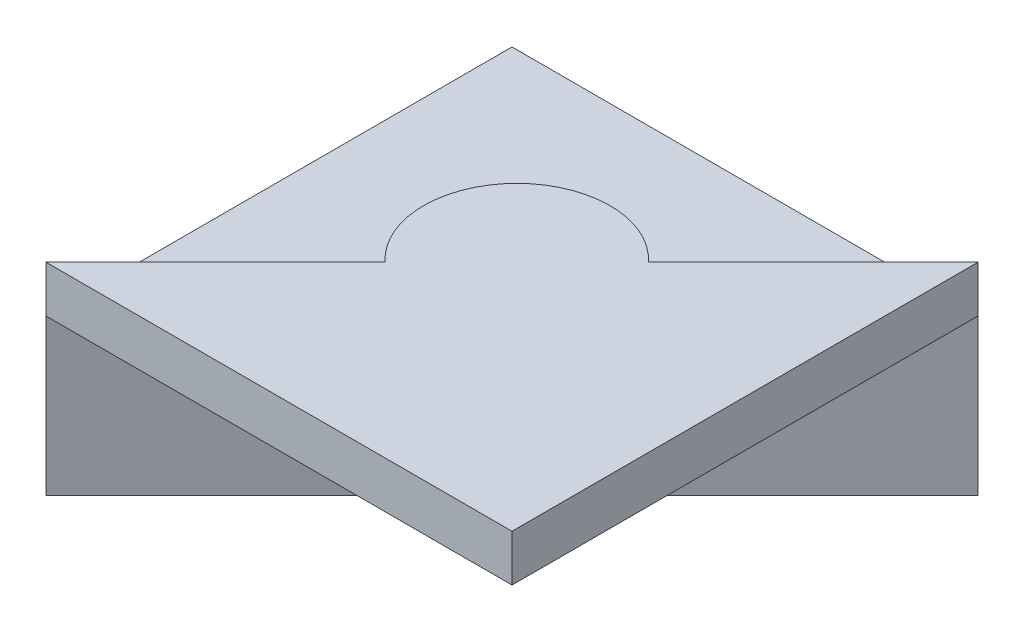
ISO-10303-21;
HEADER;
FILE_DESCRIPTION(('STEP AP214'),'2;1');
FILE_NAME('part.step','',(''),(''),'','','');
FILE_SCHEMA(('AUTOMOTIVE_DESIGN { 1 0 10303 214 1 1 1 1 }'));
ENDSEC;
DATA;
#1=APPLICATION_CONTEXT('core data for automotive mechanical design processes');
#2=APPLICATION_PROTOCOL_DEFINITION('international standard','automotive_design',2000,#1);
#3=PRODUCT_CONTEXT('',#1,'mechanical');
#4=PRODUCT('Part','Part','',(#3));
#5=PRODUCT_RELATED_PRODUCT_CATEGORY('part','',(#4));
#6=PRODUCT_DEFINITION_FORMATION('','',#4);
#7=PRODUCT_DEFINITION_CONTEXT('part definition',#1,'design');
#8=PRODUCT_DEFINITION('design','',#6,#7);
#9=PRODUCT_DEFINITION_SHAPE('','',#8);
#10=(LENGTH_UNIT() NAMED_UNIT(*) SI_UNIT(.MILLI.,.METRE.));
#11=(NAMED_UNIT(*) PLANE_ANGLE_UNIT() SI_UNIT($,.RADIAN.));
#12=(NAMED_UNIT(*) SI_UNIT($,.STERADIAN.) SOLID_ANGLE_UNIT());
#13=UNCERTAINTY_MEASURE_WITH_UNIT(LENGTH_MEASURE(1.E-05),#10,'distance_accuracy_value','');
#14=(GEOMETRIC_REPRESENTATION_CONTEXT(3) GLOBAL_UNCERTAINTY_ASSIGNED_CONTEXT((#13)) GLOBAL_UNIT_ASSIGNED_CONTEXT((#10,
#11,#12)) REPRESENTATION_CONTEXT('',''));
#15=CARTESIAN_POINT('',(0.,0.,0.));
#16=DIRECTION('',(0.,0.,1.));
#17=DIRECTION('',(1.,0.,0.));
#18=AXIS2_PLACEMENT_3D('',#15,#16,#17);
#19=CARTESIAN_POINT('',(-15.,13.,14.6929266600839));
#20=DIRECTION('',(0.,-1.,0.));
#21=DIRECTION('',(0.,0.,-1.));
#22=AXIS2_PLACEMENT_3D('',#19,#20,#21);
#23=CYLINDRICAL_SURFACE('',#22,6.);
#24=CARTESIAN_POINT('',(-15.,10.,14.6929266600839));
#25=DIRECTION('',(0.,1.,0.));
#26=DIRECTION('',(0.,0.,1.));
#27=AXIS2_PLACEMENT_3D('',#24,#25,#26);
#28=CIRCLE('',#27,6.);
#29=CARTESIAN_POINT('',(-10.6066017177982,10.,10.6066017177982));
#30=VERTEX_POINT('',#29);
#31=CARTESIAN_POINT('',(-19.0863249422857,10.,19.0863249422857));
#32=VERTEX_POINT('',#31);
#33=EDGE_CURVE('E93',#30,#32,#28,.T.);
#34=ORIENTED_EDGE('',*,*,#33,.T.);
#35=DIRECTION('',(0.,-1.,0.));
#36=VECTOR('',#35,1.);
#37=CARTESIAN_POINT('',(-19.0863249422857,13.,19.0863249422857));
#38=LINE('',#37,#36);
#39=CARTESIAN_POINT('',(-19.0863249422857,13.,19.0863249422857));
#40=VERTEX_POINT('',#39);
#41=EDGE_CURVE('E12',#40,#32,#38,.T.);
#42=ORIENTED_EDGE('',*,*,#41,.F.);
#43=CARTESIAN_POINT('',(-15.,13.,14.6929266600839));
#44=DIRECTION('',(0.,1.,0.));
#45=DIRECTION('',(0.,0.,1.));
#46=AXIS2_PLACEMENT_3D('',#43,#44,#45);
#47=CIRCLE('',#46,6.);
#48=CARTESIAN_POINT('',(-10.6066017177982,13.,10.6066017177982));
#49=VERTEX_POINT('',#48);
#50=EDGE_CURVE('E114',#49,#40,#47,.T.);
#51=ORIENTED_EDGE('',*,*,#50,.F.);
#52=DIRECTION('',(0.,-1.,0.));
#53=VECTOR('',#52,1.);
#54=CARTESIAN_POINT('',(-10.6066017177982,13.,10.6066017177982));
#55=LINE('',#54,#53);
#56=EDGE_CURVE('E106',#49,#30,#55,.T.);
#57=ORIENTED_EDGE('',*,*,#56,.T.);
#58=EDGE_LOOP('',(#34,#42,#51,#57));
#59=FACE_BOUND('',#58,.T.);
#60=ADVANCED_FACE('F43',(#59),#23,.T.);
#61=CARTESIAN_POINT('',(-30.,13.,30.));
#62=DIRECTION('',(0.707106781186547,0.,0.707106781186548));
#63=DIRECTION('',(0.707106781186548,0.,-0.707106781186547));
#64=AXIS2_PLACEMENT_3D('',#61,#62,#63);
#65=PLANE('',#64);
#66=DIRECTION('',(-0.707106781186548,0.,0.707106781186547));
#67=VECTOR('',#66,1.);
#68=CARTESIAN_POINT('',(-30.,10.,30.));
#69=LINE('',#68,#67);
#70=CARTESIAN_POINT('',(-30.,10.,30.));
#71=VERTEX_POINT('',#70);
#72=EDGE_CURVE('E89',#32,#71,#69,.T.);
#73=ORIENTED_EDGE('',*,*,#72,.T.);
#74=DIRECTION('',(0.,-1.,0.));
#75=VECTOR('',#74,1.);
#76=CARTESIAN_POINT('',(-30.,13.,30.));
#77=LINE('',#76,#75);
#78=CARTESIAN_POINT('',(-30.,13.,30.));
#79=VERTEX_POINT('',#78);
#80=EDGE_CURVE('E50',#79,#71,#77,.T.);
#81=ORIENTED_EDGE('',*,*,#80,.F.);
#82=DIRECTION('',(-0.707106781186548,0.,0.707106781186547));
#83=VECTOR('',#82,1.);
#84=CARTESIAN_POINT('',(-30.,13.,30.));
#85=LINE('',#84,#83);
#86=EDGE_CURVE('E102',#40,#79,#85,.T.);
#87=ORIENTED_EDGE('',*,*,#86,.F.);
#88=ORIENTED_EDGE('',*,*,#41,.T.);
#89=EDGE_LOOP('',(#73,#81,#87,#88));
#90=FACE_BOUND('',#89,.T.);
#91=ADVANCED_FACE('F101',(#90),#65,.F.);
#92=CARTESIAN_POINT('',(-30.,13.,30.));
#93=DIRECTION('',(0.,0.,-1.));
#94=DIRECTION('',(-1.,0.,0.));
#95=AXIS2_PLACEMENT_3D('',#92,#93,#94);
#96=PLANE('',#95);
#97=DIRECTION('',(1.,0.,0.));
#98=VECTOR('',#97,1.);
#99=CARTESIAN_POINT('',(-30.,10.,30.));
#100=LINE('',#99,#98);
#101=CARTESIAN_POINT('',(0.,10.,30.));
#102=VERTEX_POINT('',#101);
#103=EDGE_CURVE('E95',#71,#102,#100,.T.);
#104=ORIENTED_EDGE('',*,*,#103,.T.);
#105=DIRECTION('',(0.,-1.,0.));
#106=VECTOR('',#105,1.);
#107=CARTESIAN_POINT('',(0.,13.,30.));
#108=LINE('',#107,#106);
#109=CARTESIAN_POINT('',(0.,13.,30.));
#110=VERTEX_POINT('',#109);
#111=EDGE_CURVE('E125',#110,#102,#108,.T.);
#112=ORIENTED_EDGE('',*,*,#111,.F.);
#113=DIRECTION('',(1.,0.,0.));
#114=VECTOR('',#113,1.);
#115=CARTESIAN_POINT('',(-30.,13.,30.));
#116=LINE('',#115,#114);
#117=EDGE_CURVE('E117',#79,#110,#116,.T.);
#118=ORIENTED_EDGE('',*,*,#117,.F.);
#119=ORIENTED_EDGE('',*,*,#80,.T.);
#120=EDGE_LOOP('',(#104,#112,#118,#119));
#121=FACE_BOUND('',#120,.T.);
#122=ADVANCED_FACE('F129',(#121),#96,.F.);
#123=CARTESIAN_POINT('',(0.,13.,30.));
#124=DIRECTION('',(-1.,0.,0.));
#125=DIRECTION('',(0.,0.,1.));
#126=AXIS2_PLACEMENT_3D('',#123,#124,#125);
#127=PLANE('',#126);
#128=DIRECTION('',(0.,0.,-1.));
#129=VECTOR('',#128,1.);
#130=CARTESIAN_POINT('',(0.,10.,30.));
#131=LINE('',#130,#129);
#132=CARTESIAN_POINT('',(0.,10.,0.));
#133=VERTEX_POINT('',#132);
#134=EDGE_CURVE('E110',#102,#133,#131,.T.);
#135=ORIENTED_EDGE('',*,*,#134,.T.);
#136=DIRECTION('',(0.,-1.,0.));
#137=VECTOR('',#136,1.);
#138=CARTESIAN_POINT('',(0.,13.,0.));
#139=LINE('',#138,#137);
#140=CARTESIAN_POINT('',(0.,13.,0.));
#141=VERTEX_POINT('',#140);
#142=EDGE_CURVE('E122',#141,#133,#139,.T.);
#143=ORIENTED_EDGE('',*,*,#142,.F.);
#144=DIRECTION('',(0.,0.,-1.));
#145=VECTOR('',#144,1.);
#146=CARTESIAN_POINT('',(0.,13.,30.));
#147=LINE('',#146,#145);
#148=EDGE_CURVE('E62',#110,#141,#147,.T.);
#149=ORIENTED_EDGE('',*,*,#148,.F.);
#150=ORIENTED_EDGE('',*,*,#111,.T.);
#151=EDGE_LOOP('',(#135,#143,#149,#150));
#152=FACE_BOUND('',#151,.T.);
#153=ADVANCED_FACE('F140',(#152),#127,.F.);
#154=CARTESIAN_POINT('',(-10.6066017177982,13.,10.6066017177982));
#155=DIRECTION('',(0.707106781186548,0.,0.707106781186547));
#156=DIRECTION('',(0.707106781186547,0.,-0.707106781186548));
#157=AXIS2_PLACEMENT_3D('',#154,#155,#156);
#158=PLANE('',#157);
#159=DIRECTION('',(-0.707106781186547,0.,0.707106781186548));
#160=VECTOR('',#159,1.);
#161=CARTESIAN_POINT('',(-10.6066017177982,10.,10.6066017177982));
#162=LINE('',#161,#160);
#163=EDGE_CURVE('E112',#133,#30,#162,.T.);
#164=ORIENTED_EDGE('',*,*,#163,.T.);
#165=ORIENTED_EDGE('',*,*,#56,.F.);
#166=DIRECTION('',(-0.707106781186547,0.,0.707106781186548));
#167=VECTOR('',#166,1.);
#168=CARTESIAN_POINT('',(-10.6066017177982,13.,10.6066017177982));
#169=LINE('',#168,#167);
#170=EDGE_CURVE('E57',#141,#49,#169,.T.);
#171=ORIENTED_EDGE('',*,*,#170,.F.);
#172=ORIENTED_EDGE('',*,*,#142,.T.);
#173=EDGE_LOOP('',(#164,#165,#171,#172));
#174=FACE_BOUND('',#173,.T.);
#175=ADVANCED_FACE('F133',(#174),#158,.F.);
#176=CARTESIAN_POINT('',(-15.,13.,14.6929266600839));
#177=DIRECTION('',(0.,1.,0.));
#178=DIRECTION('',(0.,0.,1.));
#179=AXIS2_PLACEMENT_3D('',#176,#177,#178);
#180=PLANE('',#179);
#181=ORIENTED_EDGE('',*,*,#50,.T.);
#182=ORIENTED_EDGE('',*,*,#86,.T.);
#183=ORIENTED_EDGE('',*,*,#117,.T.);
#184=ORIENTED_EDGE('',*,*,#148,.T.);
#185=ORIENTED_EDGE('',*,*,#170,.T.);
#186=EDGE_LOOP('',(#181,#182,#183,#184,#185));
#187=FACE_BOUND('',#186,.T.);
#188=ADVANCED_FACE('F131',(#187),#180,.T.);
#189=CARTESIAN_POINT('',(-15.,10.,14.6929266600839));
#190=DIRECTION('',(0.,1.,0.));
#191=DIRECTION('',(0.,0.,1.));
#192=AXIS2_PLACEMENT_3D('',#189,#190,#191);
#193=PLANE('',#192);
#194=ORIENTED_EDGE('',*,*,#33,.F.);
#195=ORIENTED_EDGE('',*,*,#163,.F.);
#196=ORIENTED_EDGE('',*,*,#134,.F.);
#197=ORIENTED_EDGE('',*,*,#103,.F.);
#198=ORIENTED_EDGE('',*,*,#72,.F.);
#199=EDGE_LOOP('',(#194,#195,#196,#197,#198));
#200=FACE_BOUND('',#199,.T.);
#201=ADVANCED_FACE('F90',(#200),#193,.F.);
#202=CLOSED_SHELL('',(#60,#91,#122,#153,#175,#188,#201));
#203=MANIFOLD_SOLID_BREP('B2',#202);
#204=CARTESIAN_POINT('',(-10.6066017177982,10.,10.6066017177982));
#205=DIRECTION('',(-0.707106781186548,0.,-0.707106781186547));
#206=DIRECTION('',(-0.707106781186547,0.,0.707106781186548));
#207=AXIS2_PLACEMENT_3D('',#204,#205,#206);
#208=PLANE('',#207);
#209=DIRECTION('',(0.707106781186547,0.,-0.707106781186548));
#210=VECTOR('',#209,1.);
#211=CARTESIAN_POINT('',(-10.6066017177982,0.,10.6066017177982));
#212=LINE('',#211,#210);
#213=CARTESIAN_POINT('',(-10.6066017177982,0.,10.6066017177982));
#214=VERTEX_POINT('',#213);
#215=CARTESIAN_POINT('',(0.,0.,0.));
#216=VERTEX_POINT('',#215);
#217=EDGE_CURVE('E243',#214,#216,#212,.T.);
#218=ORIENTED_EDGE('',*,*,#217,.T.);
#219=DIRECTION('',(0.,-1.,0.));
#220=VECTOR('',#219,1.);
#221=CARTESIAN_POINT('',(0.,10.,0.));
#222=LINE('',#221,#220);
#223=CARTESIAN_POINT('',(0.,10.,0.));
#224=VERTEX_POINT('',#223);
#225=EDGE_CURVE('E41',#224,#216,#222,.T.);
#226=ORIENTED_EDGE('',*,*,#225,.F.);
#227=DIRECTION('',(0.707106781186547,0.,-0.707106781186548));
#228=VECTOR('',#227,1.);
#229=CARTESIAN_POINT('',(-10.6066017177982,10.,10.6066017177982));
#230=LINE('',#229,#228);
#231=CARTESIAN_POINT('',(-10.6066017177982,10.,10.6066017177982));
#232=VERTEX_POINT('',#231);
#233=EDGE_CURVE('E264',#232,#224,#230,.T.);
#234=ORIENTED_EDGE('',*,*,#233,.F.);
#235=DIRECTION('',(0.,-1.,0.));
#236=VECTOR('',#235,1.);
#237=CARTESIAN_POINT('',(-10.6066017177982,10.,10.6066017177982));
#238=LINE('',#237,#236);
#239=EDGE_CURVE('E256',#232,#214,#238,.T.);
#240=ORIENTED_EDGE('',*,*,#239,.T.);
#241=EDGE_LOOP('',(#218,#226,#234,#240));
#242=FACE_BOUND('',#241,.T.);
#243=ADVANCED_FACE('F193',(#242),#208,.F.);
#244=CARTESIAN_POINT('',(0.,10.,0.));
#245=DIRECTION('',(0.,0.,1.));
#246=DIRECTION('',(1.,0.,0.));
#247=AXIS2_PLACEMENT_3D('',#244,#245,#246);
#248=PLANE('',#247);
#249=DIRECTION('',(-1.,0.,0.));
#250=VECTOR('',#249,1.);
#251=CARTESIAN_POINT('',(0.,0.,0.));
#252=LINE('',#251,#250);
#253=CARTESIAN_POINT('',(-30.,0.,0.));
#254=VERTEX_POINT('',#253);
#255=EDGE_CURVE('E239',#216,#254,#252,.T.);
#256=ORIENTED_EDGE('',*,*,#255,.T.);
#257=DIRECTION('',(0.,-1.,0.));
#258=VECTOR('',#257,1.);
#259=CARTESIAN_POINT('',(-30.,10.,0.));
#260=LINE('',#259,#258);
#261=CARTESIAN_POINT('',(-30.,10.,0.));
#262=VERTEX_POINT('',#261);
#263=EDGE_CURVE('E200',#262,#254,#260,.T.);
#264=ORIENTED_EDGE('',*,*,#263,.F.);
#265=DIRECTION('',(-1.,0.,0.));
#266=VECTOR('',#265,1.);
#267=CARTESIAN_POINT('',(0.,10.,0.));
#268=LINE('',#267,#266);
#269=EDGE_CURVE('E252',#224,#262,#268,.T.);
#270=ORIENTED_EDGE('',*,*,#269,.F.);
#271=ORIENTED_EDGE('',*,*,#225,.T.);
#272=EDGE_LOOP('',(#256,#264,#270,#271));
#273=FACE_BOUND('',#272,.T.);
#274=ADVANCED_FACE('F251',(#273),#248,.F.);
#275=CARTESIAN_POINT('',(-30.,10.,0.));
#276=DIRECTION('',(1.,0.,0.));
#277=DIRECTION('',(0.,0.,-1.));
#278=AXIS2_PLACEMENT_3D('',#275,#276,#277);
#279=PLANE('',#278);
#280=DIRECTION('',(0.,0.,1.));
#281=VECTOR('',#280,1.);
#282=CARTESIAN_POINT('',(-30.,0.,0.));
#283=LINE('',#282,#281);
#284=CARTESIAN_POINT('',(-30.,0.,30.));
#285=VERTEX_POINT('',#284);
#286=EDGE_CURVE('E245',#254,#285,#283,.T.);
#287=ORIENTED_EDGE('',*,*,#286,.T.);
#288=DIRECTION('',(0.,-1.,0.));
#289=VECTOR('',#288,1.);
#290=CARTESIAN_POINT('',(-30.,10.,30.));
#291=LINE('',#290,#289);
#292=CARTESIAN_POINT('',(-30.,10.,30.));
#293=VERTEX_POINT('',#292);
#294=EDGE_CURVE('E275',#293,#285,#291,.T.);
#295=ORIENTED_EDGE('',*,*,#294,.F.);
#296=DIRECTION('',(0.,0.,1.));
#297=VECTOR('',#296,1.);
#298=CARTESIAN_POINT('',(-30.,10.,0.));
#299=LINE('',#298,#297);
#300=EDGE_CURVE('E267',#262,#293,#299,.T.);
#301=ORIENTED_EDGE('',*,*,#300,.F.);
#302=ORIENTED_EDGE('',*,*,#263,.T.);
#303=EDGE_LOOP('',(#287,#295,#301,#302));
#304=FACE_BOUND('',#303,.T.);
#305=ADVANCED_FACE('F279',(#304),#279,.F.);
#306=CARTESIAN_POINT('',(-30.,10.,30.));
#307=DIRECTION('',(-0.707106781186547,0.,-0.707106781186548));
#308=DIRECTION('',(-0.707106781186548,0.,0.707106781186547));
#309=AXIS2_PLACEMENT_3D('',#306,#307,#308);
#310=PLANE('',#309);
#311=DIRECTION('',(0.707106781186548,0.,-0.707106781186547));
#312=VECTOR('',#311,1.);
#313=CARTESIAN_POINT('',(-30.,0.,30.));
#314=LINE('',#313,#312);
#315=CARTESIAN_POINT('',(-19.0863249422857,0.,19.0863249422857));
#316=VERTEX_POINT('',#315);
#317=EDGE_CURVE('E260',#285,#316,#314,.T.);
#318=ORIENTED_EDGE('',*,*,#317,.T.);
#319=DIRECTION('',(0.,-1.,0.));
#320=VECTOR('',#319,1.);
#321=CARTESIAN_POINT('',(-19.0863249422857,10.,19.0863249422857));
#322=LINE('',#321,#320);
#323=CARTESIAN_POINT('',(-19.0863249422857,10.,19.0863249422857));
#324=VERTEX_POINT('',#323);
#325=EDGE_CURVE('E272',#324,#316,#322,.T.);
#326=ORIENTED_EDGE('',*,*,#325,.F.);
#327=DIRECTION('',(0.707106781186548,0.,-0.707106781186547));
#328=VECTOR('',#327,1.);
#329=CARTESIAN_POINT('',(-30.,10.,30.));
#330=LINE('',#329,#328);
#331=EDGE_CURVE('E212',#293,#324,#330,.T.);
#332=ORIENTED_EDGE('',*,*,#331,.F.);
#333=ORIENTED_EDGE('',*,*,#294,.T.);
#334=EDGE_LOOP('',(#318,#326,#332,#333));
#335=FACE_BOUND('',#334,.T.);
#336=ADVANCED_FACE('F290',(#335),#310,.F.);
#337=CARTESIAN_POINT('',(-15.,10.,14.6929266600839));
#338=DIRECTION('',(0.,-1.,0.));
#339=DIRECTION('',(0.,0.,-1.));
#340=AXIS2_PLACEMENT_3D('',#337,#338,#339);
#341=CYLINDRICAL_SURFACE('',#340,6.);
#342=CARTESIAN_POINT('',(-15.,0.,14.6929266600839));
#343=DIRECTION('',(0.,-1.,0.));
#344=DIRECTION('',(0.,0.,1.));
#345=AXIS2_PLACEMENT_3D('',#342,#343,#344);
#346=CIRCLE('',#345,6.);
#347=EDGE_CURVE('E262',#316,#214,#346,.T.);
#348=ORIENTED_EDGE('',*,*,#347,.T.);
#349=ORIENTED_EDGE('',*,*,#239,.F.);
#350=CARTESIAN_POINT('',(-15.,10.,14.6929266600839));
#351=DIRECTION('',(0.,-1.,0.));
#352=DIRECTION('',(0.,0.,1.));
#353=AXIS2_PLACEMENT_3D('',#350,#351,#352);
#354=CIRCLE('',#353,6.);
#355=EDGE_CURVE('E207',#324,#232,#354,.T.);
#356=ORIENTED_EDGE('',*,*,#355,.F.);
#357=ORIENTED_EDGE('',*,*,#325,.T.);
#358=EDGE_LOOP('',(#348,#349,#356,#357));
#359=FACE_BOUND('',#358,.T.);
#360=ADVANCED_FACE('F283',(#359),#341,.F.);
#361=CARTESIAN_POINT('',(-15.,10.,14.6929266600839));
#362=DIRECTION('',(0.,1.,0.));
#363=DIRECTION('',(0.,0.,1.));
#364=AXIS2_PLACEMENT_3D('',#361,#362,#363);
#365=PLANE('',#364);
#366=ORIENTED_EDGE('',*,*,#233,.T.);
#367=ORIENTED_EDGE('',*,*,#269,.T.);
#368=ORIENTED_EDGE('',*,*,#300,.T.);
#369=ORIENTED_EDGE('',*,*,#331,.T.);
#370=ORIENTED_EDGE('',*,*,#355,.T.);
#371=EDGE_LOOP('',(#366,#367,#368,#369,#370));
#372=FACE_BOUND('',#371,.T.);
#373=ADVANCED_FACE('F281',(#372),#365,.T.);
#374=CARTESIAN_POINT('',(-15.,0.,14.6929266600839));
#375=DIRECTION('',(0.,1.,0.));
#376=DIRECTION('',(0.,0.,1.));
#377=AXIS2_PLACEMENT_3D('',#374,#375,#376);
#378=PLANE('',#377);
#379=ORIENTED_EDGE('',*,*,#217,.F.);
#380=ORIENTED_EDGE('',*,*,#347,.F.);
#381=ORIENTED_EDGE('',*,*,#317,.F.);
#382=ORIENTED_EDGE('',*,*,#286,.F.);
#383=ORIENTED_EDGE('',*,*,#255,.F.);
#384=EDGE_LOOP('',(#379,#380,#381,#382,#383));
#385=FACE_BOUND('',#384,.T.);
#386=ADVANCED_FACE('F240',(#385),#378,.F.);
#387=CLOSED_SHELL('',(#243,#274,#305,#336,#360,#373,#386));
#388=MANIFOLD_SOLID_BREP('B6',#387);
#389=ADVANCED_BREP_SHAPE_REPRESENTATION('',(#18,#203,#388),#14);
#390=SHAPE_DEFINITION_REPRESENTATION(#9,#389);
ENDSEC;
END-ISO-10303-21;
